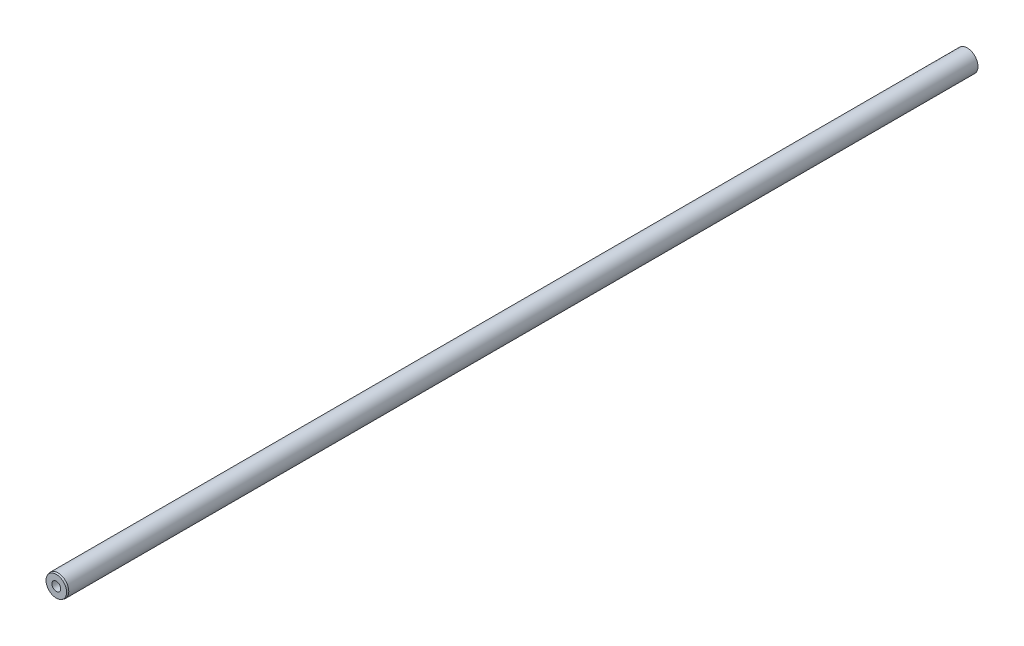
from build123d import *

# Parameters (mm, degrees)
SKETCH1_R          = 7.9375
BASE_EXTRUDE_DEPTH = 671.4744
CHAMFER1_SIZE      = 1.27
CHAMFER1_SIZE2     = 0.340295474


with BuildPart() as part:
    # Sketch1 → Base-Extrude (new body)
    with BuildSketch(Plane.XY):
        Circle(SKETCH1_R)
    extrude(amount=BASE_EXTRUDE_DEPTH)

    # Chamfer1
    chamfer1_edges = [part.edges().sort_by_distance(p)[0] for p in [
        (-7.9375, 0, 671.4744),
    ]]
    chamfer1_side = [part.faces().sort_by_distance(p)[0] for p in [
        (-7.9375, 0, 335.7372),
    ]]
    chamfer(chamfer1_edges, length=CHAMFER1_SIZE, length2=CHAMFER1_SIZE2, reference=chamfer1_side[0])

    # Sketch2 → 5_16-18 Tapped Hole1 (revolve, cut)
    with BuildSketch(Plane(origin=(0, 0, 671.4744), x_dir=(0, -1, 0), z_dir=(1, 0, 0))):
        Polygon((0, 0), (0, 17.836133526), (3.263897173, 15.87498625), (3.263897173, 0.002539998), (3.263897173, 0), align=None)
    revolve(axis=Axis((0, 0, 677.8244), (0, 0, -1)), mode=Mode.SUBTRACT)


solid = part.part
